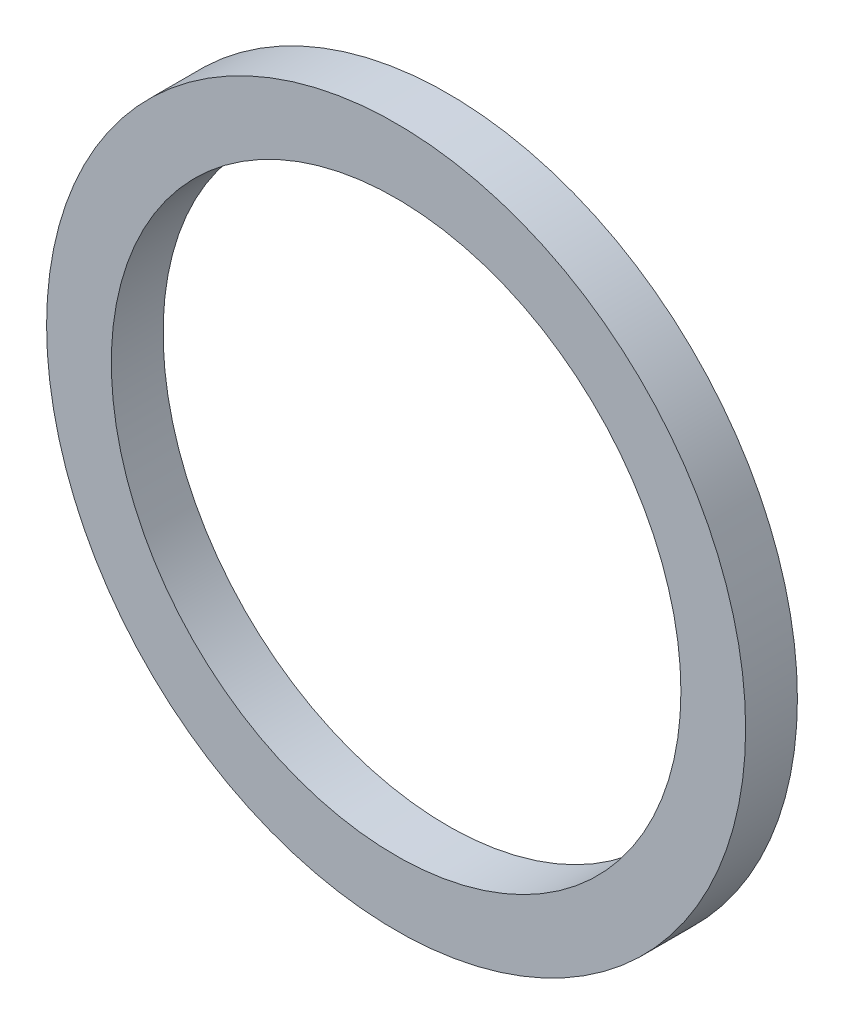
ISO-10303-21;
HEADER;
FILE_DESCRIPTION(('STEP AP214'),'2;1');
FILE_NAME('part.step','',(''),(''),'','','');
FILE_SCHEMA(('AUTOMOTIVE_DESIGN { 1 0 10303 214 1 1 1 1 }'));
ENDSEC;
DATA;
#1=APPLICATION_CONTEXT('core data for automotive mechanical design processes');
#2=APPLICATION_PROTOCOL_DEFINITION('international standard','automotive_design',2000,#1);
#3=PRODUCT_CONTEXT('',#1,'mechanical');
#4=PRODUCT('Part','Part','',(#3));
#5=PRODUCT_RELATED_PRODUCT_CATEGORY('part','',(#4));
#6=PRODUCT_DEFINITION_FORMATION('','',#4);
#7=PRODUCT_DEFINITION_CONTEXT('part definition',#1,'design');
#8=PRODUCT_DEFINITION('design','',#6,#7);
#9=PRODUCT_DEFINITION_SHAPE('','',#8);
#10=(LENGTH_UNIT() NAMED_UNIT(*) SI_UNIT(.MILLI.,.METRE.));
#11=(NAMED_UNIT(*) PLANE_ANGLE_UNIT() SI_UNIT($,.RADIAN.));
#12=(NAMED_UNIT(*) SI_UNIT($,.STERADIAN.) SOLID_ANGLE_UNIT());
#13=UNCERTAINTY_MEASURE_WITH_UNIT(LENGTH_MEASURE(1.E-05),#10,'distance_accuracy_value','');
#14=(GEOMETRIC_REPRESENTATION_CONTEXT(3) GLOBAL_UNCERTAINTY_ASSIGNED_CONTEXT((#13)) GLOBAL_UNIT_ASSIGNED_CONTEXT((#10,
#11,#12)) REPRESENTATION_CONTEXT('',''));
#15=CARTESIAN_POINT('',(0.,0.,0.));
#16=DIRECTION('',(0.,0.,1.));
#17=DIRECTION('',(1.,0.,0.));
#18=AXIS2_PLACEMENT_3D('',#15,#16,#17);
#19=CARTESIAN_POINT('',(0.,11.,0.));
#20=DIRECTION('',(0.,0.,-1.));
#21=DIRECTION('',(-1.,0.,0.));
#22=AXIS2_PLACEMENT_3D('',#19,#20,#21);
#23=PLANE('',#22);
#24=CARTESIAN_POINT('',(0.,0.,0.));
#25=DIRECTION('',(0.,0.,1.));
#26=DIRECTION('',(1.,0.,0.));
#27=AXIS2_PLACEMENT_3D('',#24,#25,#26);
#28=CIRCLE('',#27,11.);
#29=CARTESIAN_POINT('',(11.,0.,0.));
#30=VERTEX_POINT('',#29);
#31=EDGE_CURVE('E56',#30,#30,#28,.T.);
#32=ORIENTED_EDGE('',*,*,#31,.F.);
#33=EDGE_LOOP('',(#32));
#34=FACE_BOUND('',#33,.T.);
#35=CARTESIAN_POINT('',(0.,0.,0.));
#36=DIRECTION('',(0.,0.,1.));
#37=DIRECTION('',(1.,0.,0.));
#38=AXIS2_PLACEMENT_3D('',#35,#36,#37);
#39=CIRCLE('',#38,13.5);
#40=CARTESIAN_POINT('',(13.5,0.,0.));
#41=VERTEX_POINT('',#40);
#42=EDGE_CURVE('E10',#41,#41,#39,.T.);
#43=ORIENTED_EDGE('',*,*,#42,.T.);
#44=EDGE_LOOP('',(#43));
#45=FACE_BOUND('',#44,.T.);
#46=ADVANCED_FACE('F35',(#34,#45),#23,.F.);
#47=CARTESIAN_POINT('',(0.,0.,0.));
#48=DIRECTION('',(0.,0.,1.));
#49=DIRECTION('',(1.,0.,0.));
#50=AXIS2_PLACEMENT_3D('',#47,#48,#49);
#51=CYLINDRICAL_SURFACE('',#50,13.5);
#52=ORIENTED_EDGE('',*,*,#42,.F.);
#53=EDGE_LOOP('',(#52));
#54=FACE_BOUND('',#53,.T.);
#55=CARTESIAN_POINT('',(0.,0.,-2.));
#56=DIRECTION('',(0.,0.,1.));
#57=DIRECTION('',(1.,0.,0.));
#58=AXIS2_PLACEMENT_3D('',#55,#56,#57);
#59=CIRCLE('',#58,13.5);
#60=CARTESIAN_POINT('',(13.5,0.,-2.));
#61=VERTEX_POINT('',#60);
#62=EDGE_CURVE('E42',#61,#61,#59,.T.);
#63=ORIENTED_EDGE('',*,*,#62,.T.);
#64=EDGE_LOOP('',(#63));
#65=FACE_BOUND('',#64,.T.);
#66=ADVANCED_FACE('F66',(#54,#65),#51,.T.);
#67=CARTESIAN_POINT('',(0.,11.,-2.));
#68=DIRECTION('',(0.,0.,1.));
#69=DIRECTION('',(1.,0.,0.));
#70=AXIS2_PLACEMENT_3D('',#67,#68,#69);
#71=PLANE('',#70);
#72=ORIENTED_EDGE('',*,*,#62,.F.);
#73=EDGE_LOOP('',(#72));
#74=FACE_BOUND('',#73,.T.);
#75=CARTESIAN_POINT('',(0.,0.,-2.));
#76=DIRECTION('',(0.,0.,1.));
#77=DIRECTION('',(1.,0.,0.));
#78=AXIS2_PLACEMENT_3D('',#75,#76,#77);
#79=CIRCLE('',#78,11.);
#80=CARTESIAN_POINT('',(11.,0.,-2.));
#81=VERTEX_POINT('',#80);
#82=EDGE_CURVE('E49',#81,#81,#79,.T.);
#83=ORIENTED_EDGE('',*,*,#82,.T.);
#84=EDGE_LOOP('',(#83));
#85=FACE_BOUND('',#84,.T.);
#86=ADVANCED_FACE('F69',(#74,#85),#71,.F.);
#87=CARTESIAN_POINT('',(0.,0.,0.));
#88=DIRECTION('',(0.,0.,1.));
#89=DIRECTION('',(1.,0.,0.));
#90=AXIS2_PLACEMENT_3D('',#87,#88,#89);
#91=CYLINDRICAL_SURFACE('',#90,11.);
#92=ORIENTED_EDGE('',*,*,#82,.F.);
#93=EDGE_LOOP('',(#92));
#94=FACE_BOUND('',#93,.T.);
#95=ORIENTED_EDGE('',*,*,#31,.T.);
#96=EDGE_LOOP('',(#95));
#97=FACE_BOUND('',#96,.T.);
#98=ADVANCED_FACE('F63',(#94,#97),#91,.F.);
#99=CLOSED_SHELL('',(#46,#66,#86,#98));
#100=MANIFOLD_SOLID_BREP('B2',#99);
#101=ADVANCED_BREP_SHAPE_REPRESENTATION('',(#18,#100),#14);
#102=SHAPE_DEFINITION_REPRESENTATION(#9,#101);
ENDSEC;
END-ISO-10303-21;
